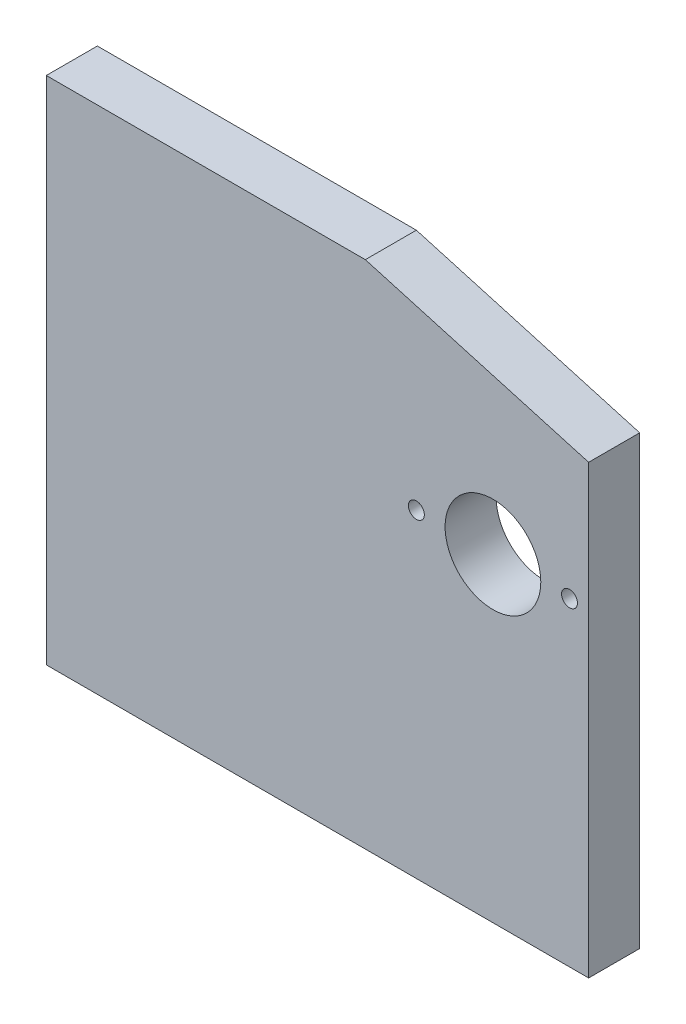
ISO-10303-21;
HEADER;
FILE_DESCRIPTION(('STEP AP214'),'2;1');
FILE_NAME('part.step','',(''),(''),'','','');
FILE_SCHEMA(('AUTOMOTIVE_DESIGN { 1 0 10303 214 1 1 1 1 }'));
ENDSEC;
DATA;
#1=APPLICATION_CONTEXT('core data for automotive mechanical design processes');
#2=APPLICATION_PROTOCOL_DEFINITION('international standard','automotive_design',2000,#1);
#3=PRODUCT_CONTEXT('',#1,'mechanical');
#4=PRODUCT('Part','Part','',(#3));
#5=PRODUCT_RELATED_PRODUCT_CATEGORY('part','',(#4));
#6=PRODUCT_DEFINITION_FORMATION('','',#4);
#7=PRODUCT_DEFINITION_CONTEXT('part definition',#1,'design');
#8=PRODUCT_DEFINITION('design','',#6,#7);
#9=PRODUCT_DEFINITION_SHAPE('','',#8);
#10=(LENGTH_UNIT() NAMED_UNIT(*) SI_UNIT(.MILLI.,.METRE.));
#11=(NAMED_UNIT(*) PLANE_ANGLE_UNIT() SI_UNIT($,.RADIAN.));
#12=(NAMED_UNIT(*) SI_UNIT($,.STERADIAN.) SOLID_ANGLE_UNIT());
#13=UNCERTAINTY_MEASURE_WITH_UNIT(LENGTH_MEASURE(1.E-05),#10,'distance_accuracy_value','');
#14=(GEOMETRIC_REPRESENTATION_CONTEXT(3) GLOBAL_UNCERTAINTY_ASSIGNED_CONTEXT((#13)) GLOBAL_UNIT_ASSIGNED_CONTEXT((#10,
#11,#12)) REPRESENTATION_CONTEXT('',''));
#15=CARTESIAN_POINT('',(0.,0.,0.));
#16=DIRECTION('',(0.,0.,1.));
#17=DIRECTION('',(1.,0.,0.));
#18=AXIS2_PLACEMENT_3D('',#15,#16,#17);
#19=CARTESIAN_POINT('',(42.5,40.,-4.));
#20=DIRECTION('',(1.,0.,0.));
#21=DIRECTION('',(0.,1.,0.));
#22=AXIS2_PLACEMENT_3D('',#19,#20,#21);
#23=PLANE('',#22);
#24=DIRECTION('',(0.,0.,1.));
#25=VECTOR('',#24,1.);
#26=CARTESIAN_POINT('',(42.5,30.,-4.));
#27=LINE('',#26,#25);
#28=CARTESIAN_POINT('',(42.5,30.,-4.));
#29=VERTEX_POINT('',#28);
#30=CARTESIAN_POINT('',(42.5,30.,4.));
#31=VERTEX_POINT('',#30);
#32=EDGE_CURVE('E142',#29,#31,#27,.T.);
#33=ORIENTED_EDGE('',*,*,#32,.T.);
#34=DIRECTION('',(0.,1.,0.));
#35=VECTOR('',#34,1.);
#36=CARTESIAN_POINT('',(42.5,40.,4.));
#37=LINE('',#36,#35);
#38=CARTESIAN_POINT('',(42.5,-40.,4.));
#39=VERTEX_POINT('',#38);
#40=EDGE_CURVE('E145',#39,#31,#37,.T.);
#41=ORIENTED_EDGE('',*,*,#40,.F.);
#42=DIRECTION('',(0.,0.,1.));
#43=VECTOR('',#42,1.);
#44=CARTESIAN_POINT('',(42.5,-40.,-4.));
#45=LINE('',#44,#43);
#46=CARTESIAN_POINT('',(42.5,-40.,-4.));
#47=VERTEX_POINT('',#46);
#48=EDGE_CURVE('E11',#47,#39,#45,.T.);
#49=ORIENTED_EDGE('',*,*,#48,.F.);
#50=DIRECTION('',(0.,1.,0.));
#51=VECTOR('',#50,1.);
#52=CARTESIAN_POINT('',(42.5,40.,-4.));
#53=LINE('',#52,#51);
#54=EDGE_CURVE('E157',#47,#29,#53,.T.);
#55=ORIENTED_EDGE('',*,*,#54,.T.);
#56=EDGE_LOOP('',(#33,#41,#49,#55));
#57=FACE_BOUND('',#56,.T.);
#58=ADVANCED_FACE('F38',(#57),#23,.T.);
#59=CARTESIAN_POINT('',(-42.5,-40.,-4.));
#60=DIRECTION('',(0.,-1.,0.));
#61=DIRECTION('',(0.,0.,-1.));
#62=AXIS2_PLACEMENT_3D('',#59,#60,#61);
#63=PLANE('',#62);
#64=CARTESIAN_POINT('',(2.5,-40.,0.));
#65=DIRECTION('',(0.,-1.,0.));
#66=DIRECTION('',(0.,0.,-1.));
#67=AXIS2_PLACEMENT_3D('',#64,#65,#66);
#68=CIRCLE('',#67,1.65);
#69=CARTESIAN_POINT('',(2.5,-40.,-1.65));
#70=VERTEX_POINT('',#69);
#71=EDGE_CURVE('E103',#70,#70,#68,.T.);
#72=ORIENTED_EDGE('',*,*,#71,.F.);
#73=EDGE_LOOP('',(#72));
#74=FACE_BOUND('',#73,.T.);
#75=ORIENTED_EDGE('',*,*,#48,.T.);
#76=DIRECTION('',(1.,0.,0.));
#77=VECTOR('',#76,1.);
#78=CARTESIAN_POINT('',(-42.5,-40.,4.));
#79=LINE('',#78,#77);
#80=CARTESIAN_POINT('',(-42.5,-40.,4.));
#81=VERTEX_POINT('',#80);
#82=EDGE_CURVE('E154',#81,#39,#79,.T.);
#83=ORIENTED_EDGE('',*,*,#82,.F.);
#84=DIRECTION('',(0.,0.,1.));
#85=VECTOR('',#84,1.);
#86=CARTESIAN_POINT('',(-42.5,-40.,-4.));
#87=LINE('',#86,#85);
#88=CARTESIAN_POINT('',(-42.5,-40.,-4.));
#89=VERTEX_POINT('',#88);
#90=EDGE_CURVE('E46',#89,#81,#87,.T.);
#91=ORIENTED_EDGE('',*,*,#90,.F.);
#92=DIRECTION('',(1.,0.,0.));
#93=VECTOR('',#92,1.);
#94=CARTESIAN_POINT('',(-42.5,-40.,-4.));
#95=LINE('',#94,#93);
#96=EDGE_CURVE('E164',#89,#47,#95,.T.);
#97=ORIENTED_EDGE('',*,*,#96,.T.);
#98=EDGE_LOOP('',(#75,#83,#91,#97));
#99=FACE_BOUND('',#98,.T.);
#100=ADVANCED_FACE('F180',(#74,#99),#63,.T.);
#101=CARTESIAN_POINT('',(-42.5,40.,-4.));
#102=DIRECTION('',(-1.,0.,0.));
#103=DIRECTION('',(0.,0.,1.));
#104=AXIS2_PLACEMENT_3D('',#101,#102,#103);
#105=PLANE('',#104);
#106=CARTESIAN_POINT('',(-42.5,25.,0.));
#107=DIRECTION('',(-1.,0.,0.));
#108=DIRECTION('',(0.,0.,1.));
#109=AXIS2_PLACEMENT_3D('',#106,#107,#108);
#110=CIRCLE('',#109,1.24999999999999);
#111=CARTESIAN_POINT('',(-42.5,25.,1.24999999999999));
#112=VERTEX_POINT('',#111);
#113=EDGE_CURVE('E102',#112,#112,#110,.T.);
#114=ORIENTED_EDGE('',*,*,#113,.F.);
#115=EDGE_LOOP('',(#114));
#116=FACE_BOUND('',#115,.T.);
#117=CARTESIAN_POINT('',(-42.5,-25.,0.));
#118=DIRECTION('',(-1.,0.,0.));
#119=DIRECTION('',(0.,0.,1.));
#120=AXIS2_PLACEMENT_3D('',#117,#118,#119);
#121=CIRCLE('',#120,1.24999999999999);
#122=CARTESIAN_POINT('',(-42.5,-25.,1.24999999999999));
#123=VERTEX_POINT('',#122);
#124=EDGE_CURVE('E113',#123,#123,#121,.T.);
#125=ORIENTED_EDGE('',*,*,#124,.F.);
#126=EDGE_LOOP('',(#125));
#127=FACE_BOUND('',#126,.T.);
#128=ORIENTED_EDGE('',*,*,#90,.T.);
#129=DIRECTION('',(0.,-1.,0.));
#130=VECTOR('',#129,1.);
#131=CARTESIAN_POINT('',(-42.5,40.,4.));
#132=LINE('',#131,#130);
#133=CARTESIAN_POINT('',(-42.5,40.,4.));
#134=VERTEX_POINT('',#133);
#135=EDGE_CURVE('E151',#134,#81,#132,.T.);
#136=ORIENTED_EDGE('',*,*,#135,.F.);
#137=DIRECTION('',(0.,0.,1.));
#138=VECTOR('',#137,1.);
#139=CARTESIAN_POINT('',(-42.5,40.,-4.));
#140=LINE('',#139,#138);
#141=CARTESIAN_POINT('',(-42.5,40.,-4.));
#142=VERTEX_POINT('',#141);
#143=EDGE_CURVE('E41',#142,#134,#140,.T.);
#144=ORIENTED_EDGE('',*,*,#143,.F.);
#145=DIRECTION('',(0.,-1.,0.));
#146=VECTOR('',#145,1.);
#147=CARTESIAN_POINT('',(-42.5,40.,-4.));
#148=LINE('',#147,#146);
#149=EDGE_CURVE('E161',#142,#89,#148,.T.);
#150=ORIENTED_EDGE('',*,*,#149,.T.);
#151=EDGE_LOOP('',(#128,#136,#144,#150));
#152=FACE_BOUND('',#151,.T.);
#153=ADVANCED_FACE('F175',(#116,#127,#152),#105,.T.);
#154=CARTESIAN_POINT('',(-42.5,40.,-4.));
#155=DIRECTION('',(0.,1.,0.));
#156=DIRECTION('',(0.,0.,1.));
#157=AXIS2_PLACEMENT_3D('',#154,#155,#156);
#158=PLANE('',#157);
#159=DIRECTION('',(0.,0.,1.));
#160=VECTOR('',#159,1.);
#161=CARTESIAN_POINT('',(7.50000000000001,40.,-4.));
#162=LINE('',#161,#160);
#163=CARTESIAN_POINT('',(7.50000000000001,40.,-4.));
#164=VERTEX_POINT('',#163);
#165=CARTESIAN_POINT('',(7.50000000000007,40.,4.));
#166=VERTEX_POINT('',#165);
#167=EDGE_CURVE('E54',#164,#166,#162,.T.);
#168=ORIENTED_EDGE('',*,*,#167,.F.);
#169=DIRECTION('',(-1.,0.,0.));
#170=VECTOR('',#169,1.);
#171=CARTESIAN_POINT('',(-42.5,40.,-4.));
#172=LINE('',#171,#170);
#173=EDGE_CURVE('E159',#164,#142,#172,.T.);
#174=ORIENTED_EDGE('',*,*,#173,.T.);
#175=ORIENTED_EDGE('',*,*,#143,.T.);
#176=DIRECTION('',(-1.,0.,0.));
#177=VECTOR('',#176,1.);
#178=CARTESIAN_POINT('',(-42.5,40.,4.));
#179=LINE('',#178,#177);
#180=EDGE_CURVE('E149',#166,#134,#179,.T.);
#181=ORIENTED_EDGE('',*,*,#180,.F.);
#182=EDGE_LOOP('',(#168,#174,#175,#181));
#183=FACE_BOUND('',#182,.T.);
#184=ADVANCED_FACE('F172',(#183),#158,.T.);
#185=CARTESIAN_POINT('',(0.,0.,-4.));
#186=DIRECTION('',(0.,0.,1.));
#187=DIRECTION('',(1.,0.,0.));
#188=AXIS2_PLACEMENT_3D('',#185,#186,#187);
#189=PLANE('',#188);
#190=CARTESIAN_POINT('',(39.5,9.99999999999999,-4.));
#191=DIRECTION('',(0.,0.,1.));
#192=DIRECTION('',(1.,0.,0.));
#193=AXIS2_PLACEMENT_3D('',#190,#191,#192);
#194=CIRCLE('',#193,1.25);
#195=CARTESIAN_POINT('',(40.75,9.99999999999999,-4.));
#196=VERTEX_POINT('',#195);
#197=EDGE_CURVE('E122',#196,#196,#194,.T.);
#198=ORIENTED_EDGE('',*,*,#197,.T.);
#199=EDGE_LOOP('',(#198));
#200=FACE_BOUND('',#199,.T.);
#201=CARTESIAN_POINT('',(15.5,9.99999999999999,-4.));
#202=DIRECTION('',(0.,0.,1.));
#203=DIRECTION('',(1.,0.,0.));
#204=AXIS2_PLACEMENT_3D('',#201,#202,#203);
#205=CIRCLE('',#204,1.25);
#206=CARTESIAN_POINT('',(16.75,9.99999999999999,-4.));
#207=VERTEX_POINT('',#206);
#208=EDGE_CURVE('E128',#207,#207,#205,.T.);
#209=ORIENTED_EDGE('',*,*,#208,.T.);
#210=EDGE_LOOP('',(#209));
#211=FACE_BOUND('',#210,.T.);
#212=CARTESIAN_POINT('',(27.5,9.99999999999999,-4.));
#213=DIRECTION('',(0.,0.,1.));
#214=DIRECTION('',(1.,0.,0.));
#215=AXIS2_PLACEMENT_3D('',#212,#213,#214);
#216=CIRCLE('',#215,7.5);
#217=CARTESIAN_POINT('',(35.,9.99999999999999,-4.));
#218=VERTEX_POINT('',#217);
#219=EDGE_CURVE('E134',#218,#218,#216,.T.);
#220=ORIENTED_EDGE('',*,*,#219,.T.);
#221=EDGE_LOOP('',(#220));
#222=FACE_BOUND('',#221,.T.);
#223=ORIENTED_EDGE('',*,*,#173,.F.);
#224=DIRECTION('',(0.961523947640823,-0.274721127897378,0.));
#225=VECTOR('',#224,1.);
#226=CARTESIAN_POINT('',(7.50000000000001,40.,-4.));
#227=LINE('',#226,#225);
#228=EDGE_CURVE('E138',#164,#29,#227,.T.);
#229=ORIENTED_EDGE('',*,*,#228,.T.);
#230=ORIENTED_EDGE('',*,*,#54,.F.);
#231=ORIENTED_EDGE('',*,*,#96,.F.);
#232=ORIENTED_EDGE('',*,*,#149,.F.);
#233=EDGE_LOOP('',(#223,#229,#230,#231,#232));
#234=FACE_BOUND('',#233,.T.);
#235=ADVANCED_FACE('F183',(#200,#211,#222,#234),#189,.F.);
#236=CARTESIAN_POINT('',(0.,0.,4.));
#237=DIRECTION('',(0.,0.,1.));
#238=DIRECTION('',(1.,0.,0.));
#239=AXIS2_PLACEMENT_3D('',#236,#237,#238);
#240=PLANE('',#239);
#241=CARTESIAN_POINT('',(39.5,9.99999999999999,4.));
#242=DIRECTION('',(0.,0.,1.));
#243=DIRECTION('',(1.,0.,0.));
#244=AXIS2_PLACEMENT_3D('',#241,#242,#243);
#245=CIRCLE('',#244,1.24999999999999);
#246=CARTESIAN_POINT('',(40.75,9.99999999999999,4.));
#247=VERTEX_POINT('',#246);
#248=EDGE_CURVE('E119',#247,#247,#245,.T.);
#249=ORIENTED_EDGE('',*,*,#248,.F.);
#250=EDGE_LOOP('',(#249));
#251=FACE_BOUND('',#250,.T.);
#252=CARTESIAN_POINT('',(15.5,9.99999999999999,4.));
#253=DIRECTION('',(0.,0.,1.));
#254=DIRECTION('',(1.,0.,0.));
#255=AXIS2_PLACEMENT_3D('',#252,#253,#254);
#256=CIRCLE('',#255,1.24999999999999);
#257=CARTESIAN_POINT('',(16.75,9.99999999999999,4.));
#258=VERTEX_POINT('',#257);
#259=EDGE_CURVE('E125',#258,#258,#256,.T.);
#260=ORIENTED_EDGE('',*,*,#259,.F.);
#261=EDGE_LOOP('',(#260));
#262=FACE_BOUND('',#261,.T.);
#263=CARTESIAN_POINT('',(27.5,9.99999999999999,4.));
#264=DIRECTION('',(0.,0.,1.));
#265=DIRECTION('',(1.,0.,0.));
#266=AXIS2_PLACEMENT_3D('',#263,#264,#265);
#267=CIRCLE('',#266,7.5);
#268=CARTESIAN_POINT('',(35.,9.99999999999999,4.));
#269=VERTEX_POINT('',#268);
#270=EDGE_CURVE('E131',#269,#269,#267,.T.);
#271=ORIENTED_EDGE('',*,*,#270,.F.);
#272=EDGE_LOOP('',(#271));
#273=FACE_BOUND('',#272,.T.);
#274=DIRECTION('',(0.961523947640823,-0.274721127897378,0.));
#275=VECTOR('',#274,1.);
#276=CARTESIAN_POINT('',(7.50000000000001,40.,4.));
#277=LINE('',#276,#275);
#278=EDGE_CURVE('E137',#166,#31,#277,.T.);
#279=ORIENTED_EDGE('',*,*,#278,.F.);
#280=ORIENTED_EDGE('',*,*,#180,.T.);
#281=ORIENTED_EDGE('',*,*,#135,.T.);
#282=ORIENTED_EDGE('',*,*,#82,.T.);
#283=ORIENTED_EDGE('',*,*,#40,.T.);
#284=EDGE_LOOP('',(#279,#280,#281,#282,#283));
#285=FACE_BOUND('',#284,.T.);
#286=ADVANCED_FACE('F178',(#251,#262,#273,#285),#240,.T.);
#287=CARTESIAN_POINT('',(7.50000000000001,40.,-4.));
#288=DIRECTION('',(-0.274721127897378,-0.961523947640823,0.));
#289=DIRECTION('',(0.961523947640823,-0.274721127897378,0.));
#290=AXIS2_PLACEMENT_3D('',#287,#288,#289);
#291=PLANE('',#290);
#292=ORIENTED_EDGE('',*,*,#278,.T.);
#293=ORIENTED_EDGE('',*,*,#32,.F.);
#294=ORIENTED_EDGE('',*,*,#228,.F.);
#295=ORIENTED_EDGE('',*,*,#167,.T.);
#296=EDGE_LOOP('',(#292,#293,#294,#295));
#297=FACE_BOUND('',#296,.T.);
#298=ADVANCED_FACE('F184',(#297),#291,.F.);
#299=CARTESIAN_POINT('',(27.5,9.99999999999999,4.));
#300=DIRECTION('',(0.,0.,1.));
#301=DIRECTION('',(1.,0.,0.));
#302=AXIS2_PLACEMENT_3D('',#299,#300,#301);
#303=CYLINDRICAL_SURFACE('',#302,7.5);
#304=ORIENTED_EDGE('',*,*,#219,.F.);
#305=EDGE_LOOP('',(#304));
#306=FACE_BOUND('',#305,.T.);
#307=ORIENTED_EDGE('',*,*,#270,.T.);
#308=EDGE_LOOP('',(#307));
#309=FACE_BOUND('',#308,.T.);
#310=ADVANCED_FACE('F186',(#306,#309),#303,.F.);
#311=CARTESIAN_POINT('',(15.5,9.99999999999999,4.));
#312=DIRECTION('',(0.,0.,1.));
#313=DIRECTION('',(1.,0.,0.));
#314=AXIS2_PLACEMENT_3D('',#311,#312,#313);
#315=CYLINDRICAL_SURFACE('',#314,1.24999999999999);
#316=ORIENTED_EDGE('',*,*,#208,.F.);
#317=EDGE_LOOP('',(#316));
#318=FACE_BOUND('',#317,.T.);
#319=ORIENTED_EDGE('',*,*,#259,.T.);
#320=EDGE_LOOP('',(#319));
#321=FACE_BOUND('',#320,.T.);
#322=ADVANCED_FACE('F192',(#318,#321),#315,.F.);
#323=CARTESIAN_POINT('',(39.5,9.99999999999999,4.));
#324=DIRECTION('',(0.,0.,1.));
#325=DIRECTION('',(1.,0.,0.));
#326=AXIS2_PLACEMENT_3D('',#323,#324,#325);
#327=CYLINDRICAL_SURFACE('',#326,1.24999999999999);
#328=ORIENTED_EDGE('',*,*,#197,.F.);
#329=EDGE_LOOP('',(#328));
#330=FACE_BOUND('',#329,.T.);
#331=ORIENTED_EDGE('',*,*,#248,.T.);
#332=EDGE_LOOP('',(#331));
#333=FACE_BOUND('',#332,.T.);
#334=ADVANCED_FACE('F228',(#330,#333),#327,.F.);
#335=CARTESIAN_POINT('',(-27.5,-25.,0.));
#336=DIRECTION('',(-1.,0.,0.));
#337=DIRECTION('',(0.,0.,1.));
#338=AXIS2_PLACEMENT_3D('',#335,#336,#337);
#339=CONICAL_SURFACE('',#338,1.25,1.02974425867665);
#340=CARTESIAN_POINT('',(-26.7489242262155,-25.,0.));
#341=VERTEX_POINT('',#340);
#342=VERTEX_LOOP('',#341);
#343=FACE_BOUND('',#342,.T.);
#344=CARTESIAN_POINT('',(-27.5,-25.,0.));
#345=DIRECTION('',(-1.,0.,0.));
#346=DIRECTION('',(0.,0.,1.));
#347=AXIS2_PLACEMENT_3D('',#344,#345,#346);
#348=CIRCLE('',#347,1.25);
#349=CARTESIAN_POINT('',(-27.5,-25.,1.25));
#350=VERTEX_POINT('',#349);
#351=EDGE_CURVE('E116',#350,#350,#348,.T.);
#352=ORIENTED_EDGE('',*,*,#351,.T.);
#353=EDGE_LOOP('',(#352));
#354=FACE_BOUND('',#353,.T.);
#355=ADVANCED_FACE('F235',(#343,#354),#339,.F.);
#356=CARTESIAN_POINT('',(-42.5,-25.,0.));
#357=DIRECTION('',(-1.,0.,0.));
#358=DIRECTION('',(0.,0.,1.));
#359=AXIS2_PLACEMENT_3D('',#356,#357,#358);
#360=CYLINDRICAL_SURFACE('',#359,1.24999999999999);
#361=ORIENTED_EDGE('',*,*,#351,.F.);
#362=EDGE_LOOP('',(#361));
#363=FACE_BOUND('',#362,.T.);
#364=ORIENTED_EDGE('',*,*,#124,.T.);
#365=EDGE_LOOP('',(#364));
#366=FACE_BOUND('',#365,.T.);
#367=ADVANCED_FACE('F241',(#363,#366),#360,.F.);
#368=CARTESIAN_POINT('',(-27.5,25.,0.));
#369=DIRECTION('',(-1.,0.,0.));
#370=DIRECTION('',(0.,0.,1.));
#371=AXIS2_PLACEMENT_3D('',#368,#369,#370);
#372=CONICAL_SURFACE('',#371,1.25,1.02974425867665);
#373=CARTESIAN_POINT('',(-26.7489242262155,25.,0.));
#374=VERTEX_POINT('',#373);
#375=VERTEX_LOOP('',#374);
#376=FACE_BOUND('',#375,.T.);
#377=CARTESIAN_POINT('',(-27.5,25.,0.));
#378=DIRECTION('',(-1.,0.,0.));
#379=DIRECTION('',(0.,0.,1.));
#380=AXIS2_PLACEMENT_3D('',#377,#378,#379);
#381=CIRCLE('',#380,1.25);
#382=CARTESIAN_POINT('',(-27.5,25.,1.25));
#383=VERTEX_POINT('',#382);
#384=EDGE_CURVE('E106',#383,#383,#381,.T.);
#385=ORIENTED_EDGE('',*,*,#384,.T.);
#386=EDGE_LOOP('',(#385));
#387=FACE_BOUND('',#386,.T.);
#388=ADVANCED_FACE('F245',(#376,#387),#372,.F.);
#389=CARTESIAN_POINT('',(-42.5,25.,0.));
#390=DIRECTION('',(-1.,0.,0.));
#391=DIRECTION('',(0.,0.,1.));
#392=AXIS2_PLACEMENT_3D('',#389,#390,#391);
#393=CYLINDRICAL_SURFACE('',#392,1.24999999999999);
#394=ORIENTED_EDGE('',*,*,#384,.F.);
#395=EDGE_LOOP('',(#394));
#396=FACE_BOUND('',#395,.T.);
#397=ORIENTED_EDGE('',*,*,#113,.T.);
#398=EDGE_LOOP('',(#397));
#399=FACE_BOUND('',#398,.T.);
#400=ADVANCED_FACE('F96',(#396,#399),#393,.F.);
#401=CARTESIAN_POINT('',(2.5,-25.,0.));
#402=DIRECTION('',(0.,-1.,0.));
#403=DIRECTION('',(0.,0.,-1.));
#404=AXIS2_PLACEMENT_3D('',#401,#402,#403);
#405=CONICAL_SURFACE('',#404,1.65,1.02974425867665);
#406=CARTESIAN_POINT('',(2.5,-24.0085799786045,0.));
#407=VERTEX_POINT('',#406);
#408=VERTEX_LOOP('',#407);
#409=FACE_BOUND('',#408,.T.);
#410=CARTESIAN_POINT('',(2.5,-25.,0.));
#411=DIRECTION('',(0.,-1.,0.));
#412=DIRECTION('',(0.,0.,-1.));
#413=AXIS2_PLACEMENT_3D('',#410,#411,#412);
#414=CIRCLE('',#413,1.65);
#415=CARTESIAN_POINT('',(2.5,-25.,-1.65));
#416=VERTEX_POINT('',#415);
#417=EDGE_CURVE('E100',#416,#416,#414,.T.);
#418=ORIENTED_EDGE('',*,*,#417,.T.);
#419=EDGE_LOOP('',(#418));
#420=FACE_BOUND('',#419,.T.);
#421=ADVANCED_FACE('F92',(#409,#420),#405,.F.);
#422=CARTESIAN_POINT('',(2.5,-40.,0.));
#423=DIRECTION('',(0.,-1.,0.));
#424=DIRECTION('',(0.,0.,-1.));
#425=AXIS2_PLACEMENT_3D('',#422,#423,#424);
#426=CYLINDRICAL_SURFACE('',#425,1.65);
#427=ORIENTED_EDGE('',*,*,#417,.F.);
#428=EDGE_LOOP('',(#427));
#429=FACE_BOUND('',#428,.T.);
#430=ORIENTED_EDGE('',*,*,#71,.T.);
#431=EDGE_LOOP('',(#430));
#432=FACE_BOUND('',#431,.T.);
#433=ADVANCED_FACE('F95',(#429,#432),#426,.F.);
#434=CLOSED_SHELL('',(#58,#100,#153,#184,#235,#286,#298,#310,#322,#334,#355,#367,#388,#400,#421,#433));
#435=MANIFOLD_SOLID_BREP('B2',#434);
#436=ADVANCED_BREP_SHAPE_REPRESENTATION('',(#18,#435),#14);
#437=SHAPE_DEFINITION_REPRESENTATION(#9,#436);
ENDSEC;
END-ISO-10303-21;
